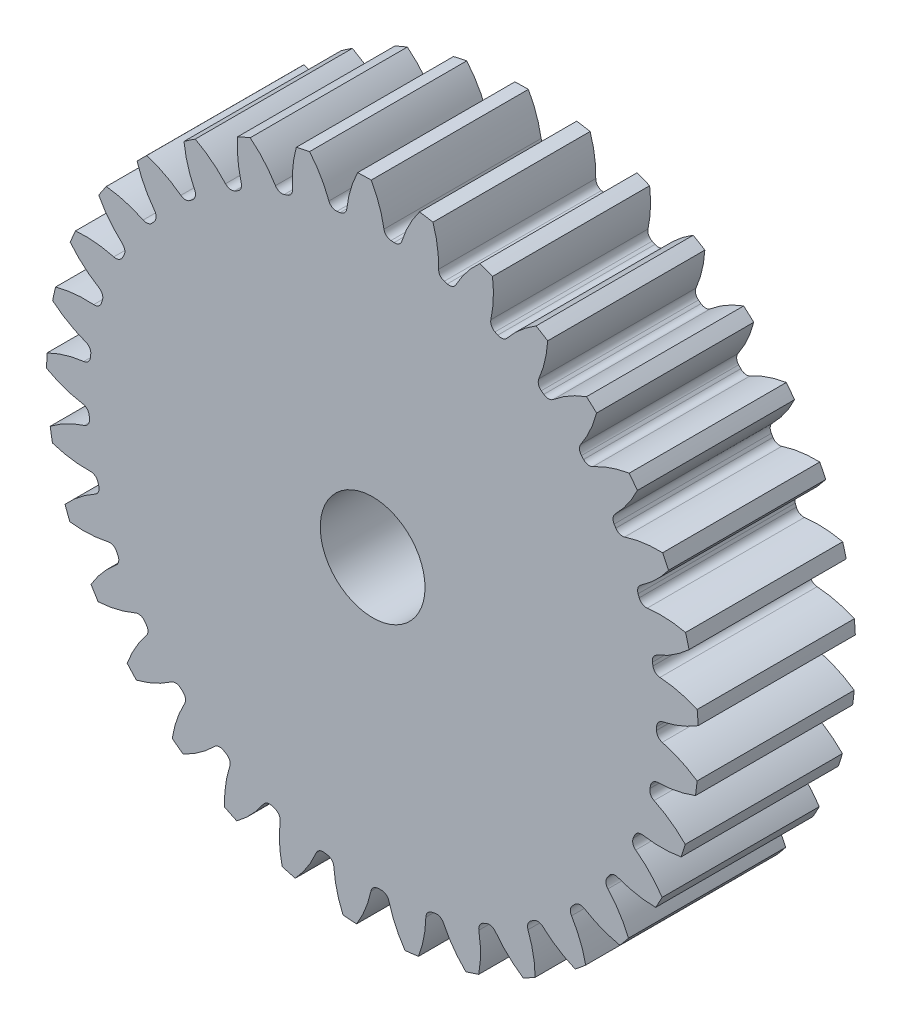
from build123d import *

# Parameters (mm, degrees)
SKETCH3_R         = 197.555555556
GEARBODY_DEPTH    = 95.25
TOOTHCUT_DEPTH    = 296.176146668
CIRPATTERN1_COUNT = 33
BOREDIA_R         = 31.75
BORE_DEPTH        = 12700


with BuildPart() as part:
    # Sketch3 → gearBody (new body)
    with BuildSketch(Plane.XY):
        Circle(SKETCH3_R)
    extrude(amount=GEARBODY_DEPTH)

    # Sketch2 → toothCut (cut, through all)
    with BuildSketch(Plane.XY):
        with BuildLine():
            ThreePointArc((172.088113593, -4.818347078), (172.112130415, -3.866506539), (172.130882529, -2.914547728))
            ThreePointArc((172.130882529, -2.914547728), (173.175926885, -0.074177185), (175.760850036, 1.49998762))
            ThreePointArc((175.760850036, 1.49998762), (187.052826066, 4.989586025), (197.555555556, 10.40979755))
            ThreePointArc((197.555555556, 10.40979755), (197.779725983, -4.443130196), (196.88877499, -19.271006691))
            ThreePointArc((196.88877499, -19.271006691), (186.640048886, -13.384612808), (175.516173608, -9.391441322))
            ThreePointArc((175.516173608, -9.391441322), (173.004549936, -7.70278237), (172.088113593, -4.818347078))
        make_face()
    toothcut = extrude(amount=TOOTHCUT_DEPTH, mode=Mode.SUBTRACT)

    # CirPattern1: toothCut ×33 about axis
    cirpattern1_axis = Axis((0, 0, 0), (0, 0, 1))
    for i in range(1, CIRPATTERN1_COUNT):
        add(toothcut.rotate(cirpattern1_axis, i * 360 / CIRPATTERN1_COUNT), mode=Mode.SUBTRACT)

    # boreDia → bore (cut, symmetric)
    with BuildSketch(Plane.XY):
        Circle(BOREDIA_R)
    extrude(amount=BORE_DEPTH, both=True, mode=Mode.SUBTRACT)


solid = part.part
